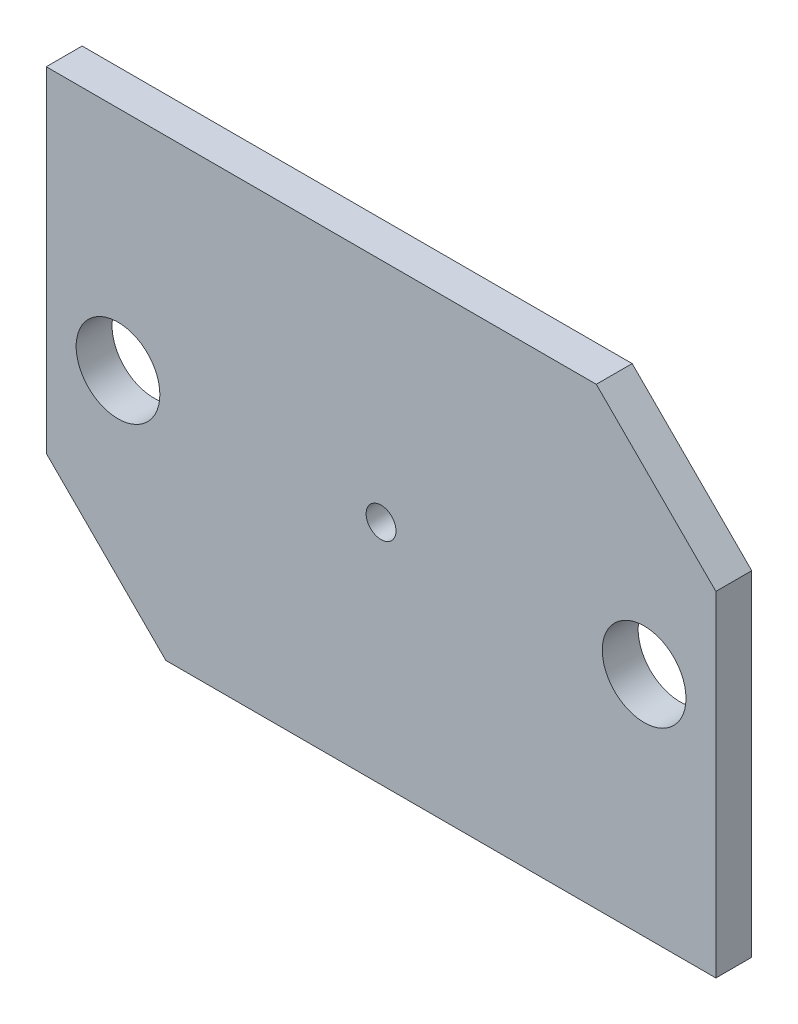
from build123d import *

# Parameters (mm, degrees)
ESQUISSE1_W          = 56
ESQUISSE1_H          = 38
ESQUISSE1_R          = 1.25
ESQUISSE1_R_2        = 3.5
BASE_EXTRUSION_DEPTH = 3
CHANFREIN1_SIZE      = 10


with BuildPart() as part:
    # Esquisse1 → Base-Extrusion (new body)
    with BuildSketch(Plane.XY):
        with Locations((-22, -21)):
            Rectangle(ESQUISSE1_W, ESQUISSE1_H)
        with Locations((-22, -21)):
            Circle(ESQUISSE1_R, mode=Mode.SUBTRACT)
        with Locations((-44, -21)):
            Circle(ESQUISSE1_R_2, mode=Mode.SUBTRACT)
        with Locations((0, -21)):
            Circle(ESQUISSE1_R_2, mode=Mode.SUBTRACT)
    extrude(amount=BASE_EXTRUSION_DEPTH)

    # Chanfrein1
    chanfrein1_edges = [part.edges().sort_by_distance(p)[0] for p in [
        (6, -2, 1.5),
        (-50, -40, 1.5),
    ]]
    chamfer(chanfrein1_edges, length=CHANFREIN1_SIZE)


solid = part.part
